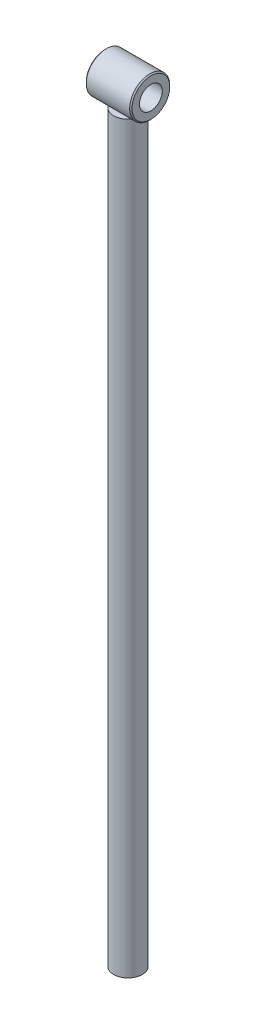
from build123d import *

# Parameters (mm, degrees)
ESQUISSE1_R      = 12.5
EXTRUSION1_DEPTH = 650
ESQUISSE2_R      = 17.5
ESQUISSE2_R_2    = 10
EXTRUSION2_DEPTH = 20
CHANFREIN1_SIZE  = 1


with BuildPart() as part:
    # Esquisse1 → Extrusion1 (new body)
    with BuildSketch(Plane(origin=(0, 0, 0), x_dir=(1, 0, 0), z_dir=(0, 1, 0))):
        with Locations(Location((0, 0, 0), (0, 0, 270))):
            Circle(ESQUISSE1_R)
    extrude(amount=EXTRUSION1_DEPTH)


with BuildPart() as body_2:
    # Esquisse2 → Extrusion2 (new, symmetric)
    with BuildSketch(Plane(origin=(0, 0, 0), x_dir=(0, 0, -1), z_dir=(1, 0, 0))):
        with Locations((0, 667.5)):
            Circle(ESQUISSE2_R)
        with Locations((0, 667.5)):
            Circle(ESQUISSE2_R_2, mode=Mode.SUBTRACT)
    extrude(amount=EXTRUSION2_DEPTH, both=True)

    # Chanfrein1
    chanfrein1_edges = [body_2.edges().sort_by_distance(p)[0] for p in [
        (-20, 667.5, 17.5),
        (20, 667.5, 17.5),
    ]]
    chamfer(chanfrein1_edges, length=CHANFREIN1_SIZE)


solid = Compound([part.part, body_2.part])
